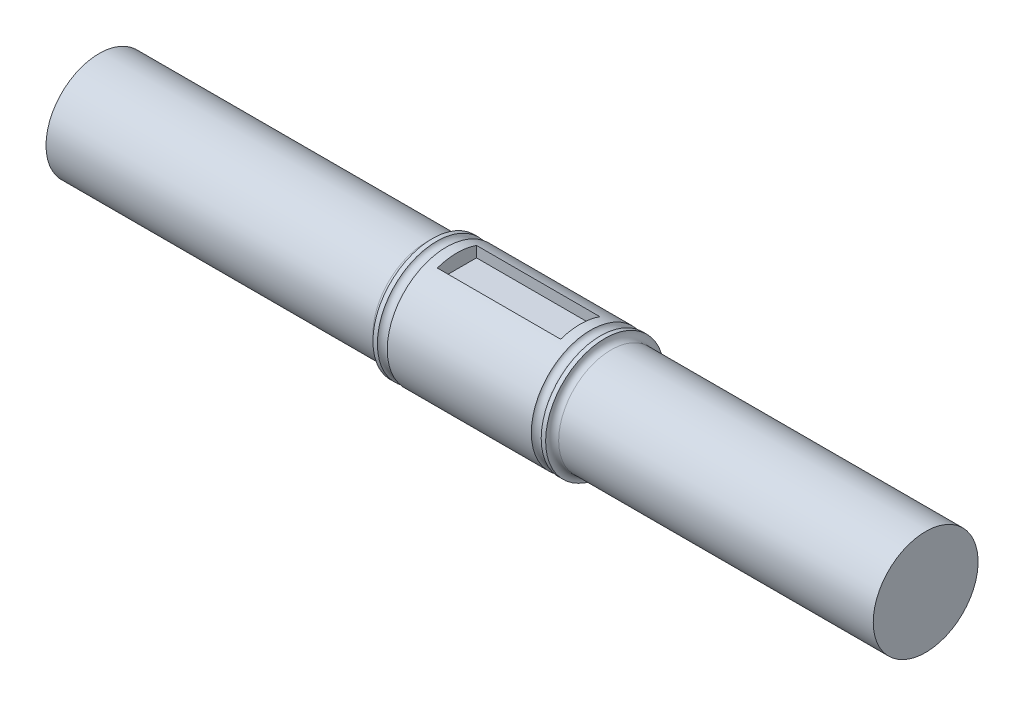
from build123d import *

# Parameters (mm, degrees)
CUT_EXTRUDE1_DEPTH      = 10
CUT_EXTRUDE1_DEPTH_BACK = 10
SKETCH8_W               = 6.35
SKETCH8_H               = 2.362


with BuildPart() as part:
    # Sketch2 → Revolve2 (revolve)
    with BuildSketch(Plane.XY, mode=Mode.PRIVATE) as revolve2_sk:
        with BuildLine():
            Line((6.653236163, 9.524185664), (6.653236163, 0.911007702))
            Line((6.653236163, 0.911007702), (59.653236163, 0.911007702))
            ThreePointArc((59.653236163, 0.911007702), (60.360342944, 0.618114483), (60.653236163, -0.088992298))
            Line((60.653236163, -0.088992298), (61.376736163, -0.088992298))
            ThreePointArc((61.376736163, -0.088992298), (62.176736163, 0.411014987), (62.976736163, -0.088992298))
            Line((62.976736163, -0.088992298), (86.333236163, -0.088992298))
            ThreePointArc((86.333236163, -0.088992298), (87.133236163, 0.409976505), (87.933236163, -0.088992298))
            Line((87.933236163, -0.088992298), (88.653236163, -0.088992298))
            ThreePointArc((88.653236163, -0.088992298), (88.902896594, 0.692483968), (89.653236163, 1.024185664))
            Line((89.653236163, 1.024185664), (140.653236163, 1.024185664))
            Line((140.653236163, 1.024185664), (140.653236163, 9.524185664))
            Line((140.653236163, 9.524185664), (6.653236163, 9.524185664))
        make_face()
    revolve(revolve2_sk.sketch.rotate(Axis((6.653236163, 9.524185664, 0), (1, 0, 0)), 270), axis=Axis((6.653236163, 9.524185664, 0), (1, 0, 0)))

    # Sketch8 → Cut-Extrude1 (cut, two sides: drawn at the far end of the back side and taken through both)
    with BuildSketch(Plane.ZY.offset(-74.653236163).offset(-CUT_EXTRUDE1_DEPTH_BACK)):
        with Locations((0, 18.03082228)):
            Rectangle(SKETCH8_W, SKETCH8_H)
    extrude(amount=CUT_EXTRUDE1_DEPTH + CUT_EXTRUDE1_DEPTH_BACK, mode=Mode.SUBTRACT)


solid = part.part
